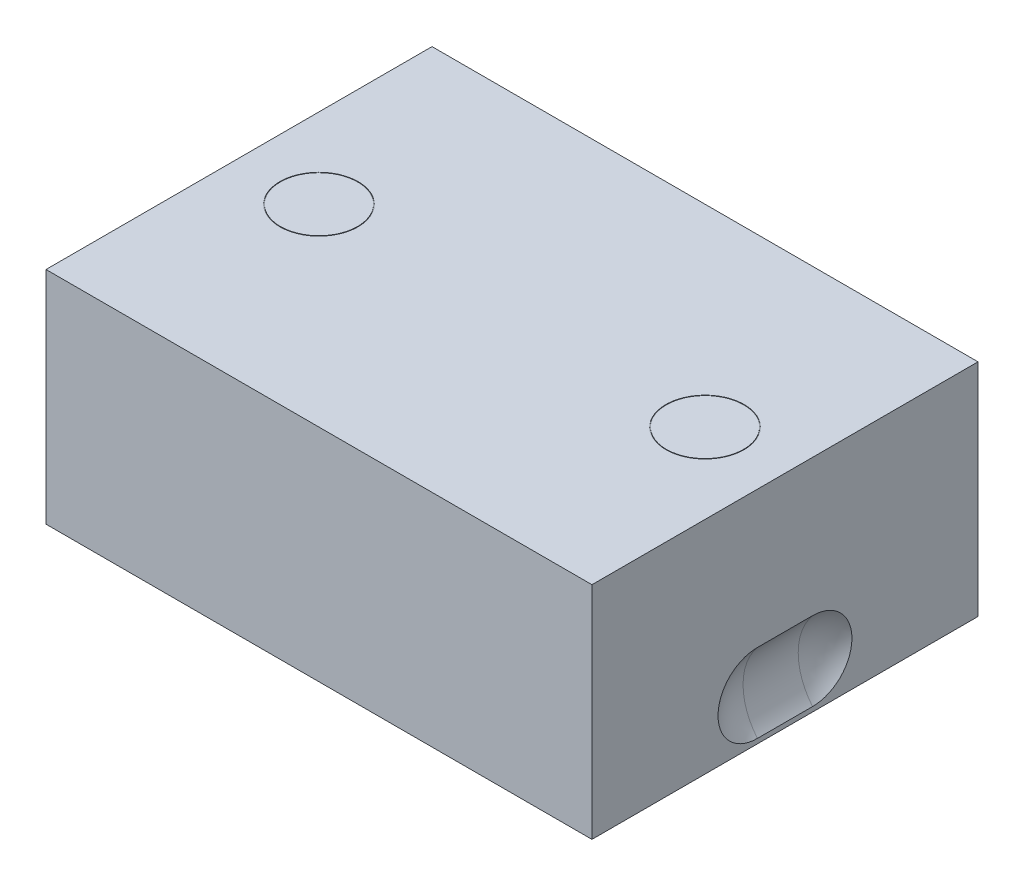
ISO-10303-21;
HEADER;
FILE_DESCRIPTION(('STEP AP214'),'2;1');
FILE_NAME('part.step','',(''),(''),'','','');
FILE_SCHEMA(('AUTOMOTIVE_DESIGN { 1 0 10303 214 1 1 1 1 }'));
ENDSEC;
DATA;
#1=APPLICATION_CONTEXT('core data for automotive mechanical design processes');
#2=APPLICATION_PROTOCOL_DEFINITION('international standard','automotive_design',2000,#1);
#3=PRODUCT_CONTEXT('',#1,'mechanical');
#4=PRODUCT('Part','Part','',(#3));
#5=PRODUCT_RELATED_PRODUCT_CATEGORY('part','',(#4));
#6=PRODUCT_DEFINITION_FORMATION('','',#4);
#7=PRODUCT_DEFINITION_CONTEXT('part definition',#1,'design');
#8=PRODUCT_DEFINITION('design','',#6,#7);
#9=PRODUCT_DEFINITION_SHAPE('','',#8);
#10=(LENGTH_UNIT() NAMED_UNIT(*) SI_UNIT(.MILLI.,.METRE.));
#11=(NAMED_UNIT(*) PLANE_ANGLE_UNIT() SI_UNIT($,.RADIAN.));
#12=(NAMED_UNIT(*) SI_UNIT($,.STERADIAN.) SOLID_ANGLE_UNIT());
#13=UNCERTAINTY_MEASURE_WITH_UNIT(LENGTH_MEASURE(1.E-05),#10,'distance_accuracy_value','');
#14=(GEOMETRIC_REPRESENTATION_CONTEXT(3) GLOBAL_UNCERTAINTY_ASSIGNED_CONTEXT((#13)) GLOBAL_UNIT_ASSIGNED_CONTEXT((#10,
#11,#12)) REPRESENTATION_CONTEXT('',''));
#15=CARTESIAN_POINT('',(0.,0.,0.));
#16=DIRECTION('',(0.,0.,1.));
#17=DIRECTION('',(1.,0.,0.));
#18=AXIS2_PLACEMENT_3D('',#15,#16,#17);
#19=CARTESIAN_POINT('',(35.,91.5,0.));
#20=DIRECTION('',(0.,1.,0.));
#21=DIRECTION('',(0.,0.,1.));
#22=AXIS2_PLACEMENT_3D('',#19,#20,#21);
#23=PLANE('',#22);
#24=CARTESIAN_POINT('',(35.,91.5,0.));
#25=DIRECTION('',(0.,-1.,0.));
#26=DIRECTION('',(0.,0.,-1.));
#27=AXIS2_PLACEMENT_3D('',#24,#25,#26);
#28=CIRCLE('',#27,7.);
#29=CARTESIAN_POINT('',(35.,91.5,-7.));
#30=VERTEX_POINT('',#29);
#31=EDGE_CURVE('E9',#30,#30,#28,.F.);
#32=ORIENTED_EDGE('',*,*,#31,.F.);
#33=EDGE_LOOP('',(#32));
#34=FACE_BOUND('',#33,.T.);
#35=ADVANCED_FACE('F14',(#34),#23,.F.);
#36=CARTESIAN_POINT('',(35.,95.,0.));
#37=DIRECTION('',(0.,1.,0.));
#38=DIRECTION('',(0.,0.,1.));
#39=AXIS2_PLACEMENT_3D('',#36,#37,#38);
#40=PLANE('',#39);
#41=CARTESIAN_POINT('',(-35.,95.,0.));
#42=DIRECTION('',(0.,1.,0.));
#43=DIRECTION('',(0.,0.,1.));
#44=AXIS2_PLACEMENT_3D('',#41,#42,#43);
#45=CIRCLE('',#44,7.1);
#46=CARTESIAN_POINT('',(-35.,95.,7.1));
#47=VERTEX_POINT('',#46);
#48=EDGE_CURVE('E344',#47,#47,#45,.T.);
#49=ORIENTED_EDGE('',*,*,#48,.F.);
#50=EDGE_LOOP('',(#49));
#51=FACE_BOUND('',#50,.T.);
#52=CARTESIAN_POINT('',(35.,95.,0.));
#53=DIRECTION('',(0.,1.,0.));
#54=DIRECTION('',(0.,0.,1.));
#55=AXIS2_PLACEMENT_3D('',#52,#53,#54);
#56=CIRCLE('',#55,7.1);
#57=CARTESIAN_POINT('',(35.,95.,7.1));
#58=VERTEX_POINT('',#57);
#59=EDGE_CURVE('E330',#58,#58,#56,.T.);
#60=ORIENTED_EDGE('',*,*,#59,.F.);
#61=EDGE_LOOP('',(#60));
#62=FACE_BOUND('',#61,.T.);
#63=DIRECTION('',(0.,0.,-1.));
#64=VECTOR('',#63,1.);
#65=CARTESIAN_POINT('',(49.5,95.,-35.));
#66=LINE('',#65,#64);
#67=CARTESIAN_POINT('',(49.5,95.,-35.));
#68=VERTEX_POINT('',#67);
#69=CARTESIAN_POINT('',(49.5,95.,35.));
#70=VERTEX_POINT('',#69);
#71=EDGE_CURVE('E92',#68,#70,#66,.F.);
#72=ORIENTED_EDGE('',*,*,#71,.F.);
#73=DIRECTION('',(-1.,0.,0.));
#74=VECTOR('',#73,1.);
#75=CARTESIAN_POINT('',(-49.5,95.,-35.));
#76=LINE('',#75,#74);
#77=CARTESIAN_POINT('',(-49.5,95.,-35.));
#78=VERTEX_POINT('',#77);
#79=EDGE_CURVE('E102',#78,#68,#76,.F.);
#80=ORIENTED_EDGE('',*,*,#79,.F.);
#81=DIRECTION('',(0.,0.,1.));
#82=VECTOR('',#81,1.);
#83=CARTESIAN_POINT('',(-49.5,95.,35.));
#84=LINE('',#83,#82);
#85=CARTESIAN_POINT('',(-49.5,95.,35.));
#86=VERTEX_POINT('',#85);
#87=EDGE_CURVE('E108',#86,#78,#84,.F.);
#88=ORIENTED_EDGE('',*,*,#87,.F.);
#89=DIRECTION('',(1.,0.,0.));
#90=VECTOR('',#89,1.);
#91=CARTESIAN_POINT('',(49.5,95.,35.));
#92=LINE('',#91,#90);
#93=EDGE_CURVE('E107',#70,#86,#92,.F.);
#94=ORIENTED_EDGE('',*,*,#93,.F.);
#95=EDGE_LOOP('',(#72,#80,#88,#94));
#96=FACE_BOUND('',#95,.T.);
#97=ADVANCED_FACE('F175',(#51,#62,#96),#40,.T.);
#98=CARTESIAN_POINT('',(-35.,91.5,0.));
#99=DIRECTION('',(0.,1.,0.));
#100=DIRECTION('',(0.,0.,1.));
#101=AXIS2_PLACEMENT_3D('',#98,#99,#100);
#102=PLANE('',#101);
#103=CARTESIAN_POINT('',(-35.,91.5,0.));
#104=DIRECTION('',(0.,1.,0.));
#105=DIRECTION('',(0.,0.,1.));
#106=AXIS2_PLACEMENT_3D('',#103,#104,#105);
#107=CIRCLE('',#106,7.);
#108=CARTESIAN_POINT('',(-35.,91.5,7.));
#109=VERTEX_POINT('',#108);
#110=EDGE_CURVE('E23',#109,#109,#107,.T.);
#111=ORIENTED_EDGE('',*,*,#110,.F.);
#112=EDGE_LOOP('',(#111));
#113=FACE_BOUND('',#112,.T.);
#114=ADVANCED_FACE('F172',(#113),#102,.F.);
#115=CARTESIAN_POINT('',(-35.,77.25,0.));
#116=DIRECTION('',(0.,1.,0.));
#117=DIRECTION('',(0.,0.,1.));
#118=AXIS2_PLACEMENT_3D('',#115,#116,#117);
#119=CYLINDRICAL_SURFACE('',#118,7.);
#120=ORIENTED_EDGE('',*,*,#110,.T.);
#121=EDGE_LOOP('',(#120));
#122=FACE_BOUND('',#121,.T.);
#123=CARTESIAN_POINT('',(-35.,63.,0.));
#124=DIRECTION('',(0.,1.,0.));
#125=DIRECTION('',(0.,0.,1.));
#126=AXIS2_PLACEMENT_3D('',#123,#124,#125);
#127=CIRCLE('',#126,7.);
#128=CARTESIAN_POINT('',(-35.,63.,7.));
#129=VERTEX_POINT('',#128);
#130=EDGE_CURVE('E17',#129,#129,#127,.F.);
#131=ORIENTED_EDGE('',*,*,#130,.T.);
#132=EDGE_LOOP('',(#131));
#133=FACE_BOUND('',#132,.T.);
#134=ADVANCED_FACE('F174',(#122,#133),#119,.F.);
#135=CARTESIAN_POINT('',(-40.6,63.,0.));
#136=DIRECTION('',(0.,-1.,0.));
#137=DIRECTION('',(0.,0.,-1.));
#138=AXIS2_PLACEMENT_3D('',#135,#136,#137);
#139=PLANE('',#138);
#140=CARTESIAN_POINT('',(-35.,63.,0.));
#141=DIRECTION('',(0.,1.,0.));
#142=DIRECTION('',(0.,0.,1.));
#143=AXIS2_PLACEMENT_3D('',#140,#141,#142);
#144=CIRCLE('',#143,4.2);
#145=CARTESIAN_POINT('',(-35.,63.,4.2));
#146=VERTEX_POINT('',#145);
#147=EDGE_CURVE('E319',#146,#146,#144,.F.);
#148=ORIENTED_EDGE('',*,*,#147,.T.);
#149=EDGE_LOOP('',(#148));
#150=FACE_BOUND('',#149,.T.);
#151=ORIENTED_EDGE('',*,*,#130,.F.);
#152=EDGE_LOOP('',(#151));
#153=FACE_BOUND('',#152,.T.);
#154=ADVANCED_FACE('F216',(#150,#153),#139,.F.);
#155=CARTESIAN_POINT('',(-35.,56.45,0.));
#156=DIRECTION('',(0.,1.,0.));
#157=DIRECTION('',(0.,0.,1.));
#158=AXIS2_PLACEMENT_3D('',#155,#156,#157);
#159=CYLINDRICAL_SURFACE('',#158,4.2);
#160=ORIENTED_EDGE('',*,*,#147,.F.);
#161=EDGE_LOOP('',(#160));
#162=FACE_BOUND('',#161,.T.);
#163=CARTESIAN_POINT('',(-35.,50.,0.));
#164=DIRECTION('',(0.,1.,0.));
#165=DIRECTION('',(0.,0.,1.));
#166=AXIS2_PLACEMENT_3D('',#163,#164,#165);
#167=CIRCLE('',#166,4.2);
#168=CARTESIAN_POINT('',(-35.,50.,4.2));
#169=VERTEX_POINT('',#168);
#170=EDGE_CURVE('E313',#169,#169,#167,.T.);
#171=ORIENTED_EDGE('',*,*,#170,.F.);
#172=EDGE_LOOP('',(#171));
#173=FACE_BOUND('',#172,.T.);
#174=ADVANCED_FACE('F225',(#162,#173),#159,.F.);
#175=CARTESIAN_POINT('',(-38.5,50.,0.));
#176=DIRECTION('',(0.,-1.,0.));
#177=DIRECTION('',(0.,0.,-1.));
#178=AXIS2_PLACEMENT_3D('',#175,#176,#177);
#179=PLANE('',#178);
#180=CARTESIAN_POINT('',(-35.,50.,0.));
#181=DIRECTION('',(0.,1.,0.));
#182=DIRECTION('',(0.,0.,1.));
#183=AXIS2_PLACEMENT_3D('',#180,#181,#182);
#184=CIRCLE('',#183,7.);
#185=CARTESIAN_POINT('',(-35.,50.,7.));
#186=VERTEX_POINT('',#185);
#187=EDGE_CURVE('E301',#186,#186,#184,.T.);
#188=ORIENTED_EDGE('',*,*,#187,.F.);
#189=EDGE_LOOP('',(#188));
#190=FACE_BOUND('',#189,.T.);
#191=ORIENTED_EDGE('',*,*,#170,.T.);
#192=EDGE_LOOP('',(#191));
#193=FACE_BOUND('',#192,.T.);
#194=ADVANCED_FACE('F233',(#190,#193),#179,.T.);
#195=CARTESIAN_POINT('',(-35.,52.5,0.));
#196=DIRECTION('',(0.,1.,0.));
#197=DIRECTION('',(0.,0.,1.));
#198=AXIS2_PLACEMENT_3D('',#195,#196,#197);
#199=CYLINDRICAL_SURFACE('',#198,7.);
#200=ORIENTED_EDGE('',*,*,#187,.T.);
#201=EDGE_LOOP('',(#200));
#202=FACE_BOUND('',#201,.T.);
#203=CARTESIAN_POINT('',(-35.,55.,0.));
#204=DIRECTION('',(0.,1.,0.));
#205=DIRECTION('',(0.,0.,1.));
#206=AXIS2_PLACEMENT_3D('',#203,#204,#205);
#207=CIRCLE('',#206,7.);
#208=CARTESIAN_POINT('',(-35.,55.,7.));
#209=VERTEX_POINT('',#208);
#210=EDGE_CURVE('E120',#209,#209,#207,.F.);
#211=ORIENTED_EDGE('',*,*,#210,.T.);
#212=EDGE_LOOP('',(#211));
#213=FACE_BOUND('',#212,.T.);
#214=ADVANCED_FACE('F241',(#202,#213),#199,.T.);
#215=CARTESIAN_POINT('',(38.5,50.,0.));
#216=DIRECTION('',(0.,-1.,0.));
#217=DIRECTION('',(0.,0.,-1.));
#218=AXIS2_PLACEMENT_3D('',#215,#216,#217);
#219=PLANE('',#218);
#220=CARTESIAN_POINT('',(35.,50.,0.));
#221=DIRECTION('',(0.,-1.,0.));
#222=DIRECTION('',(0.,0.,-1.));
#223=AXIS2_PLACEMENT_3D('',#220,#221,#222);
#224=CIRCLE('',#223,7.);
#225=CARTESIAN_POINT('',(35.,50.,-7.));
#226=VERTEX_POINT('',#225);
#227=EDGE_CURVE('E98',#226,#226,#224,.F.);
#228=ORIENTED_EDGE('',*,*,#227,.F.);
#229=EDGE_LOOP('',(#228));
#230=FACE_BOUND('',#229,.T.);
#231=CARTESIAN_POINT('',(35.,50.,0.));
#232=DIRECTION('',(0.,-1.,0.));
#233=DIRECTION('',(0.,0.,-1.));
#234=AXIS2_PLACEMENT_3D('',#231,#232,#233);
#235=CIRCLE('',#234,4.2);
#236=CARTESIAN_POINT('',(35.,50.,-4.2));
#237=VERTEX_POINT('',#236);
#238=EDGE_CURVE('E86',#237,#237,#235,.F.);
#239=ORIENTED_EDGE('',*,*,#238,.T.);
#240=EDGE_LOOP('',(#239));
#241=FACE_BOUND('',#240,.T.);
#242=ADVANCED_FACE('F237',(#230,#241),#219,.T.);
#243=CARTESIAN_POINT('',(35.,56.45,0.));
#244=DIRECTION('',(0.,-1.,0.));
#245=DIRECTION('',(0.,0.,-1.));
#246=AXIS2_PLACEMENT_3D('',#243,#244,#245);
#247=CYLINDRICAL_SURFACE('',#246,4.2);
#248=CARTESIAN_POINT('',(35.,63.,0.));
#249=DIRECTION('',(0.,-1.,0.));
#250=DIRECTION('',(0.,0.,-1.));
#251=AXIS2_PLACEMENT_3D('',#248,#249,#250);
#252=CIRCLE('',#251,4.2);
#253=CARTESIAN_POINT('',(35.,63.,-4.2));
#254=VERTEX_POINT('',#253);
#255=EDGE_CURVE('E316',#254,#254,#252,.T.);
#256=ORIENTED_EDGE('',*,*,#255,.F.);
#257=EDGE_LOOP('',(#256));
#258=FACE_BOUND('',#257,.T.);
#259=ORIENTED_EDGE('',*,*,#238,.F.);
#260=EDGE_LOOP('',(#259));
#261=FACE_BOUND('',#260,.T.);
#262=ADVANCED_FACE('F229',(#258,#261),#247,.F.);
#263=CARTESIAN_POINT('',(40.6,63.,0.));
#264=DIRECTION('',(0.,-1.,0.));
#265=DIRECTION('',(0.,0.,-1.));
#266=AXIS2_PLACEMENT_3D('',#263,#264,#265);
#267=PLANE('',#266);
#268=CARTESIAN_POINT('',(35.,63.,0.));
#269=DIRECTION('',(0.,-1.,0.));
#270=DIRECTION('',(0.,0.,-1.));
#271=AXIS2_PLACEMENT_3D('',#268,#269,#270);
#272=CIRCLE('',#271,7.);
#273=CARTESIAN_POINT('',(35.,63.,-7.));
#274=VERTEX_POINT('',#273);
#275=EDGE_CURVE('E321',#274,#274,#272,.T.);
#276=ORIENTED_EDGE('',*,*,#275,.F.);
#277=EDGE_LOOP('',(#276));
#278=FACE_BOUND('',#277,.T.);
#279=ORIENTED_EDGE('',*,*,#255,.T.);
#280=EDGE_LOOP('',(#279));
#281=FACE_BOUND('',#280,.T.);
#282=ADVANCED_FACE('F221',(#278,#281),#267,.F.);
#283=CARTESIAN_POINT('',(35.,77.25,0.));
#284=DIRECTION('',(0.,-1.,0.));
#285=DIRECTION('',(0.,0.,-1.));
#286=AXIS2_PLACEMENT_3D('',#283,#284,#285);
#287=CYLINDRICAL_SURFACE('',#286,7.);
#288=ORIENTED_EDGE('',*,*,#275,.T.);
#289=EDGE_LOOP('',(#288));
#290=FACE_BOUND('',#289,.T.);
#291=ORIENTED_EDGE('',*,*,#31,.T.);
#292=EDGE_LOOP('',(#291));
#293=FACE_BOUND('',#292,.T.);
#294=ADVANCED_FACE('F218',(#290,#293),#287,.F.);
#295=CARTESIAN_POINT('',(35.,52.5,0.));
#296=DIRECTION('',(0.,-1.,0.));
#297=DIRECTION('',(0.,0.,-1.));
#298=AXIS2_PLACEMENT_3D('',#295,#296,#297);
#299=CYLINDRICAL_SURFACE('',#298,7.);
#300=ORIENTED_EDGE('',*,*,#227,.T.);
#301=EDGE_LOOP('',(#300));
#302=FACE_BOUND('',#301,.T.);
#303=CARTESIAN_POINT('',(35.,55.,0.));
#304=DIRECTION('',(0.,-1.,0.));
#305=DIRECTION('',(0.,0.,-1.));
#306=AXIS2_PLACEMENT_3D('',#303,#304,#305);
#307=CIRCLE('',#306,7.);
#308=CARTESIAN_POINT('',(35.,55.,-7.));
#309=VERTEX_POINT('',#308);
#310=EDGE_CURVE('E134',#309,#309,#307,.T.);
#311=ORIENTED_EDGE('',*,*,#310,.T.);
#312=EDGE_LOOP('',(#311));
#313=FACE_BOUND('',#312,.T.);
#314=ADVANCED_FACE('F209',(#302,#313),#299,.T.);
#315=CARTESIAN_POINT('',(-57.9999999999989,63.,-5.00000000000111));
#316=DIRECTION('',(0.246752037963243,0.939240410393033,0.238622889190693));
#317=DIRECTION('',(-0.896514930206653,0.127757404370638,0.424192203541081));
#318=AXIS2_PLACEMENT_3D('',#315,#316,#317);
#319=SPHERICAL_SURFACE('',#318,11.1);
#320=CARTESIAN_POINT('',(-58.,63.,-5.));
#321=DIRECTION('',(0.,0.,1.));
#322=DIRECTION('',(1.,0.,0.));
#323=AXIS2_PLACEMENT_3D('',#320,#321,#322);
#324=CIRCLE('',#323,11.1);
#325=CARTESIAN_POINT('',(-49.5,55.8613726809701,-5.));
#326=VERTEX_POINT('',#325);
#327=CARTESIAN_POINT('',(-49.5,70.1386273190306,-5.));
#328=VERTEX_POINT('',#327);
#329=EDGE_CURVE('E302',#326,#328,#324,.T.);
#330=ORIENTED_EDGE('',*,*,#329,.T.);
#331=CARTESIAN_POINT('',(-49.5,55.8613726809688,-5.));
#332=CARTESIAN_POINT('',(-49.5,55.8613510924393,-5.2007761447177));
#333=CARTESIAN_POINT('',(-49.5,55.8698421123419,-5.40154918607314));
#334=CARTESIAN_POINT('',(-49.5,55.9036934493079,-5.80165887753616));
#335=CARTESIAN_POINT('',(-49.5,55.9290529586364,-6.000995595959));
#336=CARTESIAN_POINT('',(-49.5,55.9964616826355,-6.3966828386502));
#337=CARTESIAN_POINT('',(-49.5,56.0384991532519,-6.59303536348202));
#338=CARTESIAN_POINT('',(-49.5,56.1389579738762,-6.98150076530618));
#339=CARTESIAN_POINT('',(-49.5,56.1973791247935,-7.17361369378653));
#340=CARTESIAN_POINT('',(-49.5,56.3302113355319,-7.55229163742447));
#341=CARTESIAN_POINT('',(-49.5,56.4046269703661,-7.73885504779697));
#342=CARTESIAN_POINT('',(-49.5,56.5689392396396,-8.10511814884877));
#343=CARTESIAN_POINT('',(-49.5,56.6588415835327,-8.2848152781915));
#344=CARTESIAN_POINT('',(-49.5,56.8534137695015,-8.63589520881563));
#345=CARTESIAN_POINT('',(-49.5,56.9580752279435,-8.80728265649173));
#346=CARTESIAN_POINT('',(-49.5,57.1815016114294,-9.14069585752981));
#347=CARTESIAN_POINT('',(-49.5,57.300271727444,-9.30271813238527));
#348=CARTESIAN_POINT('',(-49.5,57.5509964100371,-9.61612584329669));
#349=CARTESIAN_POINT('',(-49.5,57.6829463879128,-9.76751495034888));
#350=CARTESIAN_POINT('',(-49.5,57.9591786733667,-10.058696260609));
#351=CARTESIAN_POINT('',(-49.5,58.1034655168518,-10.198484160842));
#352=CARTESIAN_POINT('',(-49.5,58.4032709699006,-10.4653776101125));
#353=CARTESIAN_POINT('',(-49.5,58.5587871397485,-10.5924858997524));
#354=CARTESIAN_POINT('',(-49.5,58.8800329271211,-10.8331956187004));
#355=CARTESIAN_POINT('',(-49.5,59.0457662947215,-10.9467920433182));
#356=CARTESIAN_POINT('',(-49.5,59.3861453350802,-11.159571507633));
#357=CARTESIAN_POINT('',(-49.5,59.5607873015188,-11.2587604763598));
#358=CARTESIAN_POINT('',(-49.5,59.9178710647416,-11.4421097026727));
#359=CARTESIAN_POINT('',(-49.5,60.1003157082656,-11.5262644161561));
#360=CARTESIAN_POINT('',(-49.5,60.4715990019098,-11.6788819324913));
#361=CARTESIAN_POINT('',(-49.5,60.6604359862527,-11.7473487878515));
#362=CARTESIAN_POINT('',(-49.5,61.0432103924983,-11.8681330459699));
#363=CARTESIAN_POINT('',(-49.5,61.2371479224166,-11.9204501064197));
#364=CARTESIAN_POINT('',(-49.5,61.6287427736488,-12.008561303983));
#365=CARTESIAN_POINT('',(-49.5,61.8264001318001,-12.0443552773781));
#366=CARTESIAN_POINT('',(-49.5,62.2240275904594,-12.0991650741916));
#367=CARTESIAN_POINT('',(-49.5,62.423997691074,-12.118180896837));
#368=CARTESIAN_POINT('',(-49.5,62.8248357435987,-12.1392995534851));
#369=CARTESIAN_POINT('',(-49.5,63.0257037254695,-12.1414018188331));
#370=CARTESIAN_POINT('',(-49.5,63.4268984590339,-12.1286770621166));
#371=CARTESIAN_POINT('',(-49.5,63.6272252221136,-12.113850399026));
#372=CARTESIAN_POINT('',(-49.5,64.0259544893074,-12.0673694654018));
#373=CARTESIAN_POINT('',(-49.5,64.224356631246,-12.0357120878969));
#374=CARTESIAN_POINT('',(-49.5,64.6177155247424,-11.955807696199));
#375=CARTESIAN_POINT('',(-49.5,64.8126735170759,-11.9075667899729));
#376=CARTESIAN_POINT('',(-49.5,65.1979040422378,-11.794815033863));
#377=CARTESIAN_POINT('',(-49.5,65.388174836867,-11.73029824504));
#378=CARTESIAN_POINT('',(-49.5,65.7625345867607,-11.5854890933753));
#379=CARTESIAN_POINT('',(-49.5,65.9466257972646,-11.505202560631));
#380=CARTESIAN_POINT('',(-49.5,66.3074632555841,-11.329374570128));
#381=CARTESIAN_POINT('',(-49.5,66.4842065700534,-11.2338270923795));
#382=CARTESIAN_POINT('',(-49.5,66.8289501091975,-11.0282175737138));
#383=CARTESIAN_POINT('',(-49.5,66.9969535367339,-10.9181609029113));
#384=CARTESIAN_POINT('',(-49.5,67.323145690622,-10.6842504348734));
#385=CARTESIAN_POINT('',(-49.5,67.4813312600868,-10.5603922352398));
#386=CARTESIAN_POINT('',(-49.5,67.7866477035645,-10.2998363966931));
#387=CARTESIAN_POINT('',(-49.5,67.93378263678,-10.1631435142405));
#388=CARTESIAN_POINT('',(-49.5,68.2160483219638,-9.87781916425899));
#389=CARTESIAN_POINT('',(-49.5,68.3511763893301,-9.7291850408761));
#390=CARTESIAN_POINT('',(-49.5,68.6083861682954,-9.42111487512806));
#391=CARTESIAN_POINT('',(-49.5,68.7304723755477,-9.26168258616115));
#392=CARTESIAN_POINT('',(-49.5,68.9608430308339,-8.9330196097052));
#393=CARTESIAN_POINT('',(-49.5,69.0691204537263,-8.76378399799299));
#394=CARTESIAN_POINT('',(-49.5,69.2710278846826,-8.41679668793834));
#395=CARTESIAN_POINT('',(-49.5,69.3646583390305,-8.23904524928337));
#396=CARTESIAN_POINT('',(-49.5,69.5366646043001,-7.87617071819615));
#397=CARTESIAN_POINT('',(-49.5,69.6150306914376,-7.69104301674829));
#398=CARTESIAN_POINT('',(-49.5,69.7558746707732,-7.31484249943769));
#399=CARTESIAN_POINT('',(-49.5,69.8183529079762,-7.12376981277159));
#400=CARTESIAN_POINT('',(-49.5,69.9269086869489,-6.73729011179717));
#401=CARTESIAN_POINT('',(-49.5,69.9730070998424,-6.54188895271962));
#402=CARTESIAN_POINT('',(-49.5,70.0485699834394,-6.14797649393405));
#403=CARTESIAN_POINT('',(-49.5,70.0780426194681,-5.94946677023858));
#404=CARTESIAN_POINT('',(-49.5,70.112281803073,-5.62543751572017));
#405=CARTESIAN_POINT('',(-49.5,70.1221676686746,-5.50043666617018));
#406=CARTESIAN_POINT('',(-49.5,70.1353356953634,-5.25029488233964));
#407=CARTESIAN_POINT('',(-49.5,70.138628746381,-5.12515452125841));
#408=CARTESIAN_POINT('',(-49.5,70.1386273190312,-5.));
#409=B_SPLINE_CURVE_WITH_KNOTS('',3,(#331,#332,#333,#334,#335,#336,#337,#338,#339,#340,#341,
#342,#343,#344,#345,#346,#347,#348,#349,#350,#351,#352,#353,#354,#355,#356,#357,#358,#359,#360,
#361,#362,#363,#364,#365,#366,#367,#368,#369,#370,#371,#372,#373,#374,#375,#376,#377,#378,#379,
#380,#381,#382,#383,#384,#385,#386,#387,#388,#389,#390,#391,#392,#393,#394,#395,#396,#397,#398,
#399,#400,#401,#402,#403,#404,#405,#406,#407,#408),.UNSPECIFIED.,.F.,.F.,(4,2,2,2,2,2,2,2,2,2,2,
2,2,2,2,2,2,2,2,2,2,2,2,2,2,2,2,2,2,2,2,2,2,2,2,2,2,2,4),(0.,0.602144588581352,1.20426034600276,
1.80595286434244,2.40763807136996,3.00949561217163,3.61157551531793,4.21331478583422,
4.81527614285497,5.41702864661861,6.019003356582,6.62084767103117,7.22291421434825,
7.82473228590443,8.42677183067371,9.0286556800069,9.63055228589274,10.2324548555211,
10.8343574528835,11.4362802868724,12.0381903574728,12.6402115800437,13.2420113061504,
13.8440309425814,14.4458284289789,15.0478638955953,15.6496771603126,16.2516829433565,
16.8534665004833,17.4553842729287,18.0570938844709,18.6591084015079,19.2611045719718,
19.8634829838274,20.4658483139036,21.0674433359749,21.6687426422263,22.0447563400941,
22.4201484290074),.UNSPECIFIED.);
#410=EDGE_CURVE('E114',#326,#328,#409,.T.);
#411=ORIENTED_EDGE('',*,*,#410,.F.);
#412=EDGE_LOOP('',(#330,#411));
#413=FACE_BOUND('',#412,.T.);
#414=ADVANCED_FACE('F264',(#413),#319,.F.);
#415=CARTESIAN_POINT('',(-57.9999999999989,63.,5.00000000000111));
#416=DIRECTION('',(0.246752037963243,0.939240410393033,0.238622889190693));
#417=DIRECTION('',(-0.896514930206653,0.127757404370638,0.424192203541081));
#418=AXIS2_PLACEMENT_3D('',#415,#416,#417);
#419=SPHERICAL_SURFACE('',#418,11.1);
#420=CARTESIAN_POINT('',(-58.,63.,5.));
#421=DIRECTION('',(0.,0.,1.));
#422=DIRECTION('',(1.,0.,0.));
#423=AXIS2_PLACEMENT_3D('',#420,#421,#422);
#424=CIRCLE('',#423,11.1);
#425=CARTESIAN_POINT('',(-49.5,55.8613726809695,5.));
#426=VERTEX_POINT('',#425);
#427=CARTESIAN_POINT('',(-49.5,70.1386273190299,5.));
#428=VERTEX_POINT('',#427);
#429=EDGE_CURVE('E298',#426,#428,#424,.T.);
#430=ORIENTED_EDGE('',*,*,#429,.F.);
#431=CARTESIAN_POINT('',(-49.5,70.1386273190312,5.));
#432=CARTESIAN_POINT('',(-49.5,70.1386489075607,5.2007761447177));
#433=CARTESIAN_POINT('',(-49.5,70.1301578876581,5.40154918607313));
#434=CARTESIAN_POINT('',(-49.5,70.0963065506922,5.80165887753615));
#435=CARTESIAN_POINT('',(-49.5,70.0709470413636,6.00099559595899));
#436=CARTESIAN_POINT('',(-49.5,70.0035383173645,6.39668283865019));
#437=CARTESIAN_POINT('',(-49.5,69.9615008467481,6.593035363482));
#438=CARTESIAN_POINT('',(-49.5,69.8610420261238,6.98150076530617));
#439=CARTESIAN_POINT('',(-49.5,69.8026208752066,7.17361369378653));
#440=CARTESIAN_POINT('',(-49.5,69.6697886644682,7.55229163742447));
#441=CARTESIAN_POINT('',(-49.5,69.595373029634,7.73885504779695));
#442=CARTESIAN_POINT('',(-49.5,69.4310607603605,8.10511814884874));
#443=CARTESIAN_POINT('',(-49.5,69.3411584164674,8.28481527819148));
#444=CARTESIAN_POINT('',(-49.5,69.1465862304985,8.63589520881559));
#445=CARTESIAN_POINT('',(-49.5,69.0419247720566,8.80728265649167));
#446=CARTESIAN_POINT('',(-49.5,68.8184983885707,9.14069585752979));
#447=CARTESIAN_POINT('',(-49.5,68.6997282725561,9.30271813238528));
#448=CARTESIAN_POINT('',(-49.5,68.449003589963,9.6161258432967));
#449=CARTESIAN_POINT('',(-49.5,68.3170536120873,9.76751495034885));
#450=CARTESIAN_POINT('',(-49.5,68.0408213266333,10.0586962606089));
#451=CARTESIAN_POINT('',(-49.5,67.8965344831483,10.198484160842));
#452=CARTESIAN_POINT('',(-49.5,67.5967290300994,10.4653776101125));
#453=CARTESIAN_POINT('',(-49.5,67.4412128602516,10.5924858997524));
#454=CARTESIAN_POINT('',(-49.5,67.1199670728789,10.8331956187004));
#455=CARTESIAN_POINT('',(-49.5,66.9542337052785,10.9467920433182));
#456=CARTESIAN_POINT('',(-49.5,66.6138546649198,11.159571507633));
#457=CARTESIAN_POINT('',(-49.5,66.4392126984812,11.2587604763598));
#458=CARTESIAN_POINT('',(-49.5,66.0821289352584,11.4421097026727));
#459=CARTESIAN_POINT('',(-49.5,65.8996842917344,11.5262644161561));
#460=CARTESIAN_POINT('',(-49.5,65.5284009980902,11.6788819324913));
#461=CARTESIAN_POINT('',(-49.5,65.3395640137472,11.7473487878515));
#462=CARTESIAN_POINT('',(-49.5,64.9567896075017,11.8681330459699));
#463=CARTESIAN_POINT('',(-49.5,64.7628520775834,11.9204501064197));
#464=CARTESIAN_POINT('',(-49.5,64.3712572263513,12.008561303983));
#465=CARTESIAN_POINT('',(-49.5,64.1735998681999,12.0443552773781));
#466=CARTESIAN_POINT('',(-49.5,63.7759724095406,12.0991650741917));
#467=CARTESIAN_POINT('',(-49.5,63.576002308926,12.118180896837));
#468=CARTESIAN_POINT('',(-49.5,63.1751642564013,12.1392995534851));
#469=CARTESIAN_POINT('',(-49.5,62.9742962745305,12.1414018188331));
#470=CARTESIAN_POINT('',(-49.5,62.5731015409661,12.1286770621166));
#471=CARTESIAN_POINT('',(-49.5,62.3727747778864,12.113850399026));
#472=CARTESIAN_POINT('',(-49.5,61.9740455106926,12.0673694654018));
#473=CARTESIAN_POINT('',(-49.5,61.775643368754,12.0357120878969));
#474=CARTESIAN_POINT('',(-49.5,61.3822844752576,11.955807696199));
#475=CARTESIAN_POINT('',(-49.5,61.187326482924,11.9075667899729));
#476=CARTESIAN_POINT('',(-49.5,60.8020959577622,11.794815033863));
#477=CARTESIAN_POINT('',(-49.5,60.611825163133,11.73029824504));
#478=CARTESIAN_POINT('',(-49.5,60.2374654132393,11.5854890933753));
#479=CARTESIAN_POINT('',(-49.5,60.0533742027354,11.505202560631));
#480=CARTESIAN_POINT('',(-49.5,59.6925367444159,11.329374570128));
#481=CARTESIAN_POINT('',(-49.5,59.5157934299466,11.2338270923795));
#482=CARTESIAN_POINT('',(-49.5,59.1710498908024,11.0282175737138));
#483=CARTESIAN_POINT('',(-49.5,59.0030464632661,10.9181609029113));
#484=CARTESIAN_POINT('',(-49.5,58.676854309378,10.6842504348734));
#485=CARTESIAN_POINT('',(-49.5,58.5186687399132,10.5603922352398));
#486=CARTESIAN_POINT('',(-49.5,58.2133522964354,10.2998363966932));
#487=CARTESIAN_POINT('',(-49.5,58.06621736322,10.1631435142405));
#488=CARTESIAN_POINT('',(-49.5,57.7839516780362,9.87781916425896));
#489=CARTESIAN_POINT('',(-49.5,57.6488236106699,9.72918504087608));
#490=CARTESIAN_POINT('',(-49.5,57.3916138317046,9.42111487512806));
#491=CARTESIAN_POINT('',(-49.5,57.2695276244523,9.26168258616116));
#492=CARTESIAN_POINT('',(-49.5,57.0391569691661,8.93301960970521));
#493=CARTESIAN_POINT('',(-49.5,56.9308795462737,8.763783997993));
#494=CARTESIAN_POINT('',(-49.5,56.7289721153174,8.41679668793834));
#495=CARTESIAN_POINT('',(-49.5,56.6353416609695,8.23904524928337));
#496=CARTESIAN_POINT('',(-49.5,56.4633353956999,7.87617071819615));
#497=CARTESIAN_POINT('',(-49.5,56.3849693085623,7.6910430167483));
#498=CARTESIAN_POINT('',(-49.5,56.2441253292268,7.31484249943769));
#499=CARTESIAN_POINT('',(-49.5,56.1816470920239,7.12376981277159));
#500=CARTESIAN_POINT('',(-49.5,56.0730913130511,6.73729011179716));
#501=CARTESIAN_POINT('',(-49.5,56.0269929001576,6.54188895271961));
#502=CARTESIAN_POINT('',(-49.5,55.9514300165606,6.14797649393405));
#503=CARTESIAN_POINT('',(-49.5,55.9219573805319,5.94946677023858));
#504=CARTESIAN_POINT('',(-49.5,55.887718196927,5.62543751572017));
#505=CARTESIAN_POINT('',(-49.5,55.8778323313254,5.50043666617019));
#506=CARTESIAN_POINT('',(-49.5,55.8646643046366,5.25029488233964));
#507=CARTESIAN_POINT('',(-49.5,55.861371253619,5.12515452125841));
#508=CARTESIAN_POINT('',(-49.5,55.8613726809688,5.));
#509=B_SPLINE_CURVE_WITH_KNOTS('',3,(#431,#432,#433,#434,#435,#436,#437,#438,#439,#440,#441,
#442,#443,#444,#445,#446,#447,#448,#449,#450,#451,#452,#453,#454,#455,#456,#457,#458,#459,#460,
#461,#462,#463,#464,#465,#466,#467,#468,#469,#470,#471,#472,#473,#474,#475,#476,#477,#478,#479,
#480,#481,#482,#483,#484,#485,#486,#487,#488,#489,#490,#491,#492,#493,#494,#495,#496,#497,#498,
#499,#500,#501,#502,#503,#504,#505,#506,#507,#508),.UNSPECIFIED.,.F.,.F.,(4,2,2,2,2,2,2,2,2,2,2,
2,2,2,2,2,2,2,2,2,2,2,2,2,2,2,2,2,2,2,2,2,2,2,2,2,2,2,4),(0.,0.602144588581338,1.20426034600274,
1.80595286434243,2.40763807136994,3.0094956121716,3.6115755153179,4.21331478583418,
4.81527614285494,5.41702864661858,6.01900335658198,6.62084767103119,7.22291421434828,
7.82473228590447,8.42677183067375,9.02865568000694,9.63055228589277,10.2324548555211,
10.8343574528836,11.4362802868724,12.0381903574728,12.6402115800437,13.2420113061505,
13.8440309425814,14.4458284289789,15.0478638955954,15.6496771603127,16.2516829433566,
16.8534665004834,17.4553842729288,18.0570938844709,18.6591084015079,19.2611045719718,
19.8634829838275,20.4658483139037,21.067443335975,21.6687426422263,22.0447563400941,
22.4201484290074),.UNSPECIFIED.);
#510=EDGE_CURVE('E111',#428,#426,#509,.T.);
#511=ORIENTED_EDGE('',*,*,#510,.F.);
#512=EDGE_LOOP('',(#430,#511));
#513=FACE_BOUND('',#512,.T.);
#514=ADVANCED_FACE('F152',(#513),#419,.F.);
#515=CARTESIAN_POINT('',(-58.,63.,0.));
#516=DIRECTION('',(0.,0.,1.));
#517=DIRECTION('',(1.,0.,0.));
#518=AXIS2_PLACEMENT_3D('',#515,#516,#517);
#519=CYLINDRICAL_SURFACE('',#518,11.1);
#520=ORIENTED_EDGE('',*,*,#329,.F.);
#521=DIRECTION('',(0.,0.,1.));
#522=VECTOR('',#521,1.);
#523=CARTESIAN_POINT('',(-49.5,55.8613726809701,35.));
#524=LINE('',#523,#522);
#525=EDGE_CURVE('E101',#426,#326,#524,.F.);
#526=ORIENTED_EDGE('',*,*,#525,.F.);
#527=ORIENTED_EDGE('',*,*,#429,.T.);
#528=DIRECTION('',(0.,0.,1.));
#529=VECTOR('',#528,1.);
#530=CARTESIAN_POINT('',(-49.5,70.1386273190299,35.));
#531=LINE('',#530,#529);
#532=EDGE_CURVE('E112',#328,#428,#531,.T.);
#533=ORIENTED_EDGE('',*,*,#532,.F.);
#534=EDGE_LOOP('',(#520,#526,#527,#533));
#535=FACE_BOUND('',#534,.T.);
#536=ADVANCED_FACE('F251',(#535),#519,.F.);
#537=CARTESIAN_POINT('',(57.9999999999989,63.,5.00000000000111));
#538=DIRECTION('',(0.246752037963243,0.939240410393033,0.238622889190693));
#539=DIRECTION('',(-0.896514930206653,0.127757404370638,0.424192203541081));
#540=AXIS2_PLACEMENT_3D('',#537,#538,#539);
#541=SPHERICAL_SURFACE('',#540,11.1);
#542=CARTESIAN_POINT('',(58.,63.,5.));
#543=DIRECTION('',(0.,0.,-1.));
#544=DIRECTION('',(-1.,0.,0.));
#545=AXIS2_PLACEMENT_3D('',#542,#543,#544);
#546=CIRCLE('',#545,11.1);
#547=CARTESIAN_POINT('',(49.5,55.8613726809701,5.));
#548=VERTEX_POINT('',#547);
#549=CARTESIAN_POINT('',(49.5,70.1386273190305,5.));
#550=VERTEX_POINT('',#549);
#551=EDGE_CURVE('E71',#548,#550,#546,.T.);
#552=ORIENTED_EDGE('',*,*,#551,.T.);
#553=CARTESIAN_POINT('',(49.5,55.8613726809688,5.));
#554=CARTESIAN_POINT('',(49.5,55.8613510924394,5.2007761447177));
#555=CARTESIAN_POINT('',(49.5,55.869842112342,5.40154918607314));
#556=CARTESIAN_POINT('',(49.5,55.9036934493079,5.80165887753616));
#557=CARTESIAN_POINT('',(49.5,55.9290529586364,6.00099559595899));
#558=CARTESIAN_POINT('',(49.5,55.9964616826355,6.3966828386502));
#559=CARTESIAN_POINT('',(49.5,56.0384991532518,6.59303536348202));
#560=CARTESIAN_POINT('',(49.5,56.1389579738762,6.98150076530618));
#561=CARTESIAN_POINT('',(49.5,56.1973791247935,7.17361369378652));
#562=CARTESIAN_POINT('',(49.5,56.3302113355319,7.55229163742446));
#563=CARTESIAN_POINT('',(49.5,56.4046269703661,7.73885504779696));
#564=CARTESIAN_POINT('',(49.5,56.5689392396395,8.10511814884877));
#565=CARTESIAN_POINT('',(49.5,56.6588415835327,8.28481527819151));
#566=CARTESIAN_POINT('',(49.5,56.8534137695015,8.63589520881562));
#567=CARTESIAN_POINT('',(49.5,56.9580752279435,8.80728265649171));
#568=CARTESIAN_POINT('',(49.5,57.1815016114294,9.1406958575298));
#569=CARTESIAN_POINT('',(49.5,57.300271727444,9.30271813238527));
#570=CARTESIAN_POINT('',(49.5,57.5509964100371,9.61612584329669));
#571=CARTESIAN_POINT('',(49.5,57.6829463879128,9.76751495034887));
#572=CARTESIAN_POINT('',(49.5,57.9591786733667,10.0586962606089));
#573=CARTESIAN_POINT('',(49.5,58.1034655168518,10.198484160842));
#574=CARTESIAN_POINT('',(49.5,58.4032709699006,10.4653776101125));
#575=CARTESIAN_POINT('',(49.5,58.5587871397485,10.5924858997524));
#576=CARTESIAN_POINT('',(49.5,58.8800329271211,10.8331956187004));
#577=CARTESIAN_POINT('',(49.5,59.0457662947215,10.9467920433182));
#578=CARTESIAN_POINT('',(49.5,59.3861453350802,11.1595715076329));
#579=CARTESIAN_POINT('',(49.5,59.5607873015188,11.2587604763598));
#580=CARTESIAN_POINT('',(49.5,59.9178710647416,11.4421097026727));
#581=CARTESIAN_POINT('',(49.5,60.1003157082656,11.5262644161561));
#582=CARTESIAN_POINT('',(49.5,60.4715990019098,11.6788819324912));
#583=CARTESIAN_POINT('',(49.5,60.6604359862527,11.7473487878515));
#584=CARTESIAN_POINT('',(49.5,61.0432103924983,11.8681330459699));
#585=CARTESIAN_POINT('',(49.5,61.2371479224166,11.9204501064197));
#586=CARTESIAN_POINT('',(49.5,61.6287427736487,12.008561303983));
#587=CARTESIAN_POINT('',(49.5,61.8264001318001,12.0443552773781));
#588=CARTESIAN_POINT('',(49.5,62.2240275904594,12.0991650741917));
#589=CARTESIAN_POINT('',(49.5,62.423997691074,12.118180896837));
#590=CARTESIAN_POINT('',(49.5,62.8248357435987,12.1392995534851));
#591=CARTESIAN_POINT('',(49.5,63.0257037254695,12.1414018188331));
#592=CARTESIAN_POINT('',(49.5,63.4268984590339,12.1286770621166));
#593=CARTESIAN_POINT('',(49.5,63.6272252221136,12.113850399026));
#594=CARTESIAN_POINT('',(49.5,64.0259544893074,12.0673694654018));
#595=CARTESIAN_POINT('',(49.5,64.224356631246,12.0357120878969));
#596=CARTESIAN_POINT('',(49.5,64.6177155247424,11.955807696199));
#597=CARTESIAN_POINT('',(49.5,64.8126735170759,11.9075667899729));
#598=CARTESIAN_POINT('',(49.5,65.1979040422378,11.794815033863));
#599=CARTESIAN_POINT('',(49.5,65.388174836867,11.7302982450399));
#600=CARTESIAN_POINT('',(49.5,65.7625345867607,11.5854890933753));
#601=CARTESIAN_POINT('',(49.5,65.9466257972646,11.505202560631));
#602=CARTESIAN_POINT('',(49.5,66.3074632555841,11.329374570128));
#603=CARTESIAN_POINT('',(49.5,66.4842065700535,11.2338270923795));
#604=CARTESIAN_POINT('',(49.5,66.8289501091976,11.0282175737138));
#605=CARTESIAN_POINT('',(49.5,66.9969535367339,10.9181609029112));
#606=CARTESIAN_POINT('',(49.5,67.323145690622,10.6842504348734));
#607=CARTESIAN_POINT('',(49.5,67.4813312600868,10.5603922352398));
#608=CARTESIAN_POINT('',(49.5,67.7866477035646,10.2998363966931));
#609=CARTESIAN_POINT('',(49.5,67.93378263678,10.1631435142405));
#610=CARTESIAN_POINT('',(49.5,68.2160483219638,9.87781916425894));
#611=CARTESIAN_POINT('',(49.5,68.3511763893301,9.72918504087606));
#612=CARTESIAN_POINT('',(49.5,68.6083861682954,9.42111487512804));
#613=CARTESIAN_POINT('',(49.5,68.7304723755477,9.26168258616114));
#614=CARTESIAN_POINT('',(49.5,68.9608430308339,8.93301960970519));
#615=CARTESIAN_POINT('',(49.5,69.0691204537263,8.76378399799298));
#616=CARTESIAN_POINT('',(49.5,69.2710278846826,8.41679668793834));
#617=CARTESIAN_POINT('',(49.5,69.3646583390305,8.23904524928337));
#618=CARTESIAN_POINT('',(49.5,69.5366646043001,7.87617071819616));
#619=CARTESIAN_POINT('',(49.5,69.6150306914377,7.69104301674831));
#620=CARTESIAN_POINT('',(49.5,69.7558746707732,7.31484249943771));
#621=CARTESIAN_POINT('',(49.5,69.8183529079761,7.1237698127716));
#622=CARTESIAN_POINT('',(49.5,69.9269086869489,6.73729011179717));
#623=CARTESIAN_POINT('',(49.5,69.9730070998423,6.54188895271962));
#624=CARTESIAN_POINT('',(49.5,70.0485699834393,6.14797649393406));
#625=CARTESIAN_POINT('',(49.5,70.0780426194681,5.94946677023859));
#626=CARTESIAN_POINT('',(49.5,70.112281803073,5.62543751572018));
#627=CARTESIAN_POINT('',(49.5,70.1221676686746,5.50043666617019));
#628=CARTESIAN_POINT('',(49.5,70.1353356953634,5.25029488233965));
#629=CARTESIAN_POINT('',(49.5,70.138628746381,5.12515452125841));
#630=CARTESIAN_POINT('',(49.5,70.1386273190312,5.));
#631=B_SPLINE_CURVE_WITH_KNOTS('',3,(#553,#554,#555,#556,#557,#558,#559,#560,#561,#562,#563,
#564,#565,#566,#567,#568,#569,#570,#571,#572,#573,#574,#575,#576,#577,#578,#579,#580,#581,#582,
#583,#584,#585,#586,#587,#588,#589,#590,#591,#592,#593,#594,#595,#596,#597,#598,#599,#600,#601,
#602,#603,#604,#605,#606,#607,#608,#609,#610,#611,#612,#613,#614,#615,#616,#617,#618,#619,#620,
#621,#622,#623,#624,#625,#626,#627,#628,#629,#630),.UNSPECIFIED.,.F.,.F.,(4,2,2,2,2,2,2,2,2,2,2,
2,2,2,2,2,2,2,2,2,2,2,2,2,2,2,2,2,2,2,2,2,2,2,2,2,2,2,4),(0.,0.602144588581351,1.20426034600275,
1.80595286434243,2.40763807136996,3.00949561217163,3.61157551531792,4.21331478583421,
4.81527614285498,5.41702864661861,6.01900335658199,6.62084767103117,7.22291421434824,
7.82473228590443,8.42677183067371,9.0286556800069,9.63055228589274,10.2324548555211,
10.8343574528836,11.4362802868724,12.0381903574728,12.6402115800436,13.2420113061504,
13.8440309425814,14.4458284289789,15.0478638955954,15.6496771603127,16.2516829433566,
16.8534665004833,17.4553842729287,18.0570938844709,18.6591084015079,19.2611045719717,
19.8634829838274,20.4658483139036,21.0674433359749,21.6687426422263,22.0447563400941,
22.4201484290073),.UNSPECIFIED.);
#632=EDGE_CURVE('E76',#548,#550,#631,.T.);
#633=ORIENTED_EDGE('',*,*,#632,.F.);
#634=EDGE_LOOP('',(#552,#633));
#635=FACE_BOUND('',#634,.T.);
#636=ADVANCED_FACE('F84',(#635),#541,.F.);
#637=CARTESIAN_POINT('',(57.9999999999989,63.,-5.00000000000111));
#638=DIRECTION('',(0.246752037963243,0.939240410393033,0.238622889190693));
#639=DIRECTION('',(-0.896514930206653,0.127757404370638,0.424192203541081));
#640=AXIS2_PLACEMENT_3D('',#637,#638,#639);
#641=SPHERICAL_SURFACE('',#640,11.1);
#642=CARTESIAN_POINT('',(58.,63.,-5.));
#643=DIRECTION('',(0.,0.,-1.));
#644=DIRECTION('',(-1.,0.,0.));
#645=AXIS2_PLACEMENT_3D('',#642,#643,#644);
#646=CIRCLE('',#645,11.1);
#647=CARTESIAN_POINT('',(49.5,55.8613726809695,-5.));
#648=VERTEX_POINT('',#647);
#649=CARTESIAN_POINT('',(49.5,70.1386273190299,-5.));
#650=VERTEX_POINT('',#649);
#651=EDGE_CURVE('E85',#648,#650,#646,.T.);
#652=ORIENTED_EDGE('',*,*,#651,.F.);
#653=CARTESIAN_POINT('',(49.5,70.1386273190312,-5.));
#654=CARTESIAN_POINT('',(49.5,70.1386489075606,-5.20077614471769));
#655=CARTESIAN_POINT('',(49.5,70.130157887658,-5.40154918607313));
#656=CARTESIAN_POINT('',(49.5,70.0963065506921,-5.80165887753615));
#657=CARTESIAN_POINT('',(49.5,70.0709470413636,-6.00099559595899));
#658=CARTESIAN_POINT('',(49.5,70.0035383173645,-6.3966828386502));
#659=CARTESIAN_POINT('',(49.5,69.9615008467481,-6.59303536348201));
#660=CARTESIAN_POINT('',(49.5,69.8610420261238,-6.98150076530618));
#661=CARTESIAN_POINT('',(49.5,69.8026208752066,-7.17361369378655));
#662=CARTESIAN_POINT('',(49.5,69.6697886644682,-7.55229163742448));
#663=CARTESIAN_POINT('',(49.5,69.595373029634,-7.73885504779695));
#664=CARTESIAN_POINT('',(49.5,69.4310607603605,-8.10511814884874));
#665=CARTESIAN_POINT('',(49.5,69.3411584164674,-8.28481527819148));
#666=CARTESIAN_POINT('',(49.5,69.1465862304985,-8.63589520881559));
#667=CARTESIAN_POINT('',(49.5,69.0419247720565,-8.80728265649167));
#668=CARTESIAN_POINT('',(49.5,68.8184983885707,-9.14069585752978));
#669=CARTESIAN_POINT('',(49.5,68.6997282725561,-9.30271813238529));
#670=CARTESIAN_POINT('',(49.5,68.449003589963,-9.61612584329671));
#671=CARTESIAN_POINT('',(49.5,68.3170536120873,-9.76751495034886));
#672=CARTESIAN_POINT('',(49.5,68.0408213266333,-10.0586962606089));
#673=CARTESIAN_POINT('',(49.5,67.8965344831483,-10.198484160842));
#674=CARTESIAN_POINT('',(49.5,67.5967290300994,-10.4653776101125));
#675=CARTESIAN_POINT('',(49.5,67.4412128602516,-10.5924858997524));
#676=CARTESIAN_POINT('',(49.5,67.1199670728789,-10.8331956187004));
#677=CARTESIAN_POINT('',(49.5,66.9542337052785,-10.9467920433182));
#678=CARTESIAN_POINT('',(49.5,66.6138546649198,-11.159571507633));
#679=CARTESIAN_POINT('',(49.5,66.4392126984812,-11.2587604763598));
#680=CARTESIAN_POINT('',(49.5,66.0821289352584,-11.4421097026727));
#681=CARTESIAN_POINT('',(49.5,65.8996842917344,-11.5262644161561));
#682=CARTESIAN_POINT('',(49.5,65.5284009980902,-11.6788819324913));
#683=CARTESIAN_POINT('',(49.5,65.3395640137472,-11.7473487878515));
#684=CARTESIAN_POINT('',(49.5,64.9567896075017,-11.8681330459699));
#685=CARTESIAN_POINT('',(49.5,64.7628520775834,-11.9204501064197));
#686=CARTESIAN_POINT('',(49.5,64.3712572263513,-12.008561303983));
#687=CARTESIAN_POINT('',(49.5,64.1735998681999,-12.0443552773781));
#688=CARTESIAN_POINT('',(49.5,63.7759724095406,-12.0991650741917));
#689=CARTESIAN_POINT('',(49.5,63.576002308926,-12.118180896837));
#690=CARTESIAN_POINT('',(49.5,63.1751642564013,-12.1392995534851));
#691=CARTESIAN_POINT('',(49.5,62.9742962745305,-12.1414018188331));
#692=CARTESIAN_POINT('',(49.5,62.5731015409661,-12.1286770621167));
#693=CARTESIAN_POINT('',(49.5,62.3727747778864,-12.113850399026));
#694=CARTESIAN_POINT('',(49.5,61.9740455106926,-12.0673694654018));
#695=CARTESIAN_POINT('',(49.5,61.775643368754,-12.0357120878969));
#696=CARTESIAN_POINT('',(49.5,61.3822844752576,-11.955807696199));
#697=CARTESIAN_POINT('',(49.5,61.1873264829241,-11.9075667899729));
#698=CARTESIAN_POINT('',(49.5,60.8020959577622,-11.794815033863));
#699=CARTESIAN_POINT('',(49.5,60.611825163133,-11.7302982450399));
#700=CARTESIAN_POINT('',(49.5,60.2374654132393,-11.5854890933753));
#701=CARTESIAN_POINT('',(49.5,60.0533742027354,-11.505202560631));
#702=CARTESIAN_POINT('',(49.5,59.6925367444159,-11.329374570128));
#703=CARTESIAN_POINT('',(49.5,59.5157934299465,-11.2338270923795));
#704=CARTESIAN_POINT('',(49.5,59.1710498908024,-11.0282175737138));
#705=CARTESIAN_POINT('',(49.5,59.0030464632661,-10.9181609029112));
#706=CARTESIAN_POINT('',(49.5,58.676854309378,-10.6842504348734));
#707=CARTESIAN_POINT('',(49.5,58.5186687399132,-10.5603922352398));
#708=CARTESIAN_POINT('',(49.5,58.2133522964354,-10.2998363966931));
#709=CARTESIAN_POINT('',(49.5,58.06621736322,-10.1631435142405));
#710=CARTESIAN_POINT('',(49.5,57.7839516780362,-9.87781916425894));
#711=CARTESIAN_POINT('',(49.5,57.6488236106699,-9.72918504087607));
#712=CARTESIAN_POINT('',(49.5,57.3916138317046,-9.42111487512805));
#713=CARTESIAN_POINT('',(49.5,57.2695276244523,-9.26168258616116));
#714=CARTESIAN_POINT('',(49.5,57.0391569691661,-8.9330196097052));
#715=CARTESIAN_POINT('',(49.5,56.9308795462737,-8.76378399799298));
#716=CARTESIAN_POINT('',(49.5,56.7289721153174,-8.41679668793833));
#717=CARTESIAN_POINT('',(49.5,56.6353416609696,-8.23904524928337));
#718=CARTESIAN_POINT('',(49.5,56.4633353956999,-7.87617071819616));
#719=CARTESIAN_POINT('',(49.5,56.3849693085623,-7.69104301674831));
#720=CARTESIAN_POINT('',(49.5,56.2441253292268,-7.3148424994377));
#721=CARTESIAN_POINT('',(49.5,56.1816470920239,-7.12376981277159));
#722=CARTESIAN_POINT('',(49.5,56.0730913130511,-6.73729011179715));
#723=CARTESIAN_POINT('',(49.5,56.0269929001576,-6.5418889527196));
#724=CARTESIAN_POINT('',(49.5,55.9514300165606,-6.14797649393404));
#725=CARTESIAN_POINT('',(49.5,55.9219573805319,-5.94946677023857));
#726=CARTESIAN_POINT('',(49.5,55.887718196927,-5.62543751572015));
#727=CARTESIAN_POINT('',(49.5,55.8778323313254,-5.50043666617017));
#728=CARTESIAN_POINT('',(49.5,55.8646643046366,-5.25029488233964));
#729=CARTESIAN_POINT('',(49.5,55.861371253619,-5.1251545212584));
#730=CARTESIAN_POINT('',(49.5,55.8613726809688,-5.));
#731=B_SPLINE_CURVE_WITH_KNOTS('',3,(#653,#654,#655,#656,#657,#658,#659,#660,#661,#662,#663,
#664,#665,#666,#667,#668,#669,#670,#671,#672,#673,#674,#675,#676,#677,#678,#679,#680,#681,#682,
#683,#684,#685,#686,#687,#688,#689,#690,#691,#692,#693,#694,#695,#696,#697,#698,#699,#700,#701,
#702,#703,#704,#705,#706,#707,#708,#709,#710,#711,#712,#713,#714,#715,#716,#717,#718,#719,#720,
#721,#722,#723,#724,#725,#726,#727,#728,#729,#730),.UNSPECIFIED.,.F.,.F.,(4,2,2,2,2,2,2,2,2,2,2,
2,2,2,2,2,2,2,2,2,2,2,2,2,2,2,2,2,2,2,2,2,2,2,2,2,2,2,4),(0.,0.602144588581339,1.20426034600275,
1.80595286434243,2.40763807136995,3.00949561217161,3.6115755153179,4.21331478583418,
4.81527614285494,5.41702864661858,6.01900335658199,6.6208476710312,7.22291421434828,
7.82473228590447,8.42677183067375,9.02865568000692,9.63055228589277,10.2324548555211,
10.8343574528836,11.4362802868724,12.0381903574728,12.6402115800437,13.2420113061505,
13.8440309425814,14.4458284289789,15.0478638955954,15.6496771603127,16.2516829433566,
16.8534665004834,17.4553842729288,18.0570938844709,18.6591084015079,19.2611045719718,
19.8634829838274,20.4658483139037,21.067443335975,21.6687426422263,22.0447563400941,
22.4201484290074),.UNSPECIFIED.);
#732=EDGE_CURVE('E90',#650,#648,#731,.T.);
#733=ORIENTED_EDGE('',*,*,#732,.F.);
#734=EDGE_LOOP('',(#652,#733));
#735=FACE_BOUND('',#734,.T.);
#736=ADVANCED_FACE('F250',(#735),#641,.F.);
#737=CARTESIAN_POINT('',(58.,63.,0.));
#738=DIRECTION('',(0.,0.,-1.));
#739=DIRECTION('',(-1.,0.,0.));
#740=AXIS2_PLACEMENT_3D('',#737,#738,#739);
#741=CYLINDRICAL_SURFACE('',#740,11.1);
#742=ORIENTED_EDGE('',*,*,#551,.F.);
#743=DIRECTION('',(0.,0.,-1.));
#744=VECTOR('',#743,1.);
#745=CARTESIAN_POINT('',(49.5,55.8613726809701,-35.));
#746=LINE('',#745,#744);
#747=EDGE_CURVE('E81',#648,#548,#746,.F.);
#748=ORIENTED_EDGE('',*,*,#747,.F.);
#749=ORIENTED_EDGE('',*,*,#651,.T.);
#750=DIRECTION('',(0.,0.,-1.));
#751=VECTOR('',#750,1.);
#752=CARTESIAN_POINT('',(49.5,70.1386273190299,-35.));
#753=LINE('',#752,#751);
#754=EDGE_CURVE('E79',#550,#650,#753,.T.);
#755=ORIENTED_EDGE('',*,*,#754,.F.);
#756=EDGE_LOOP('',(#742,#748,#749,#755));
#757=FACE_BOUND('',#756,.T.);
#758=ADVANCED_FACE('F88',(#757),#741,.F.);
#759=CARTESIAN_POINT('',(0.,55.,0.));
#760=DIRECTION('',(0.,1.,0.));
#761=DIRECTION('',(0.,0.,1.));
#762=AXIS2_PLACEMENT_3D('',#759,#760,#761);
#763=PLANE('',#762);
#764=DIRECTION('',(0.,0.,1.));
#765=VECTOR('',#764,1.);
#766=CARTESIAN_POINT('',(-49.5,55.,0.));
#767=LINE('',#766,#765);
#768=CARTESIAN_POINT('',(-49.5,55.,-35.));
#769=VERTEX_POINT('',#768);
#770=CARTESIAN_POINT('',(-49.5,55.,35.));
#771=VERTEX_POINT('',#770);
#772=EDGE_CURVE('E125',#769,#771,#767,.T.);
#773=ORIENTED_EDGE('',*,*,#772,.F.);
#774=DIRECTION('',(1.,0.,0.));
#775=VECTOR('',#774,1.);
#776=CARTESIAN_POINT('',(0.,55.,-35.));
#777=LINE('',#776,#775);
#778=CARTESIAN_POINT('',(49.5,55.,-35.));
#779=VERTEX_POINT('',#778);
#780=EDGE_CURVE('E128',#779,#769,#777,.F.);
#781=ORIENTED_EDGE('',*,*,#780,.F.);
#782=DIRECTION('',(0.,0.,1.));
#783=VECTOR('',#782,1.);
#784=CARTESIAN_POINT('',(49.5,55.,0.));
#785=LINE('',#784,#783);
#786=CARTESIAN_POINT('',(49.5,55.,35.));
#787=VERTEX_POINT('',#786);
#788=EDGE_CURVE('E131',#787,#779,#785,.F.);
#789=ORIENTED_EDGE('',*,*,#788,.F.);
#790=DIRECTION('',(1.,0.,0.));
#791=VECTOR('',#790,1.);
#792=CARTESIAN_POINT('',(0.,55.,35.));
#793=LINE('',#792,#791);
#794=EDGE_CURVE('E123',#771,#787,#793,.T.);
#795=ORIENTED_EDGE('',*,*,#794,.F.);
#796=EDGE_LOOP('',(#773,#781,#789,#795));
#797=FACE_BOUND('',#796,.T.);
#798=ORIENTED_EDGE('',*,*,#310,.F.);
#799=EDGE_LOOP('',(#798));
#800=FACE_BOUND('',#799,.T.);
#801=ORIENTED_EDGE('',*,*,#210,.F.);
#802=EDGE_LOOP('',(#801));
#803=FACE_BOUND('',#802,.T.);
#804=ADVANCED_FACE('F168',(#797,#800,#803),#763,.F.);
#805=CARTESIAN_POINT('',(49.5,55.,35.));
#806=DIRECTION('',(0.,0.,1.));
#807=DIRECTION('',(1.,0.,0.));
#808=AXIS2_PLACEMENT_3D('',#805,#806,#807);
#809=PLANE('',#808);
#810=ORIENTED_EDGE('',*,*,#794,.T.);
#811=DIRECTION('',(0.,1.,0.));
#812=VECTOR('',#811,1.);
#813=CARTESIAN_POINT('',(49.5,55.,35.));
#814=LINE('',#813,#812);
#815=EDGE_CURVE('E117',#787,#70,#814,.T.);
#816=ORIENTED_EDGE('',*,*,#815,.T.);
#817=ORIENTED_EDGE('',*,*,#93,.T.);
#818=DIRECTION('',(0.,1.,0.));
#819=VECTOR('',#818,1.);
#820=CARTESIAN_POINT('',(-49.5,55.,35.));
#821=LINE('',#820,#819);
#822=EDGE_CURVE('E32',#86,#771,#821,.F.);
#823=ORIENTED_EDGE('',*,*,#822,.T.);
#824=EDGE_LOOP('',(#810,#816,#817,#823));
#825=FACE_BOUND('',#824,.T.);
#826=ADVANCED_FACE('F162',(#825),#809,.T.);
#827=CARTESIAN_POINT('',(-49.5,55.,35.));
#828=DIRECTION('',(-1.,0.,0.));
#829=DIRECTION('',(0.,0.,1.));
#830=AXIS2_PLACEMENT_3D('',#827,#828,#829);
#831=PLANE('',#830);
#832=ORIENTED_EDGE('',*,*,#772,.T.);
#833=ORIENTED_EDGE('',*,*,#822,.F.);
#834=ORIENTED_EDGE('',*,*,#87,.T.);
#835=DIRECTION('',(0.,1.,0.));
#836=VECTOR('',#835,1.);
#837=CARTESIAN_POINT('',(-49.5,55.,-35.));
#838=LINE('',#837,#836);
#839=EDGE_CURVE('E105',#78,#769,#838,.F.);
#840=ORIENTED_EDGE('',*,*,#839,.T.);
#841=EDGE_LOOP('',(#832,#833,#834,#840));
#842=FACE_BOUND('',#841,.T.);
#843=ORIENTED_EDGE('',*,*,#532,.T.);
#844=ORIENTED_EDGE('',*,*,#510,.T.);
#845=ORIENTED_EDGE('',*,*,#525,.T.);
#846=ORIENTED_EDGE('',*,*,#410,.T.);
#847=EDGE_LOOP('',(#843,#844,#845,#846));
#848=FACE_BOUND('',#847,.T.);
#849=ADVANCED_FACE('F156',(#842,#848),#831,.T.);
#850=CARTESIAN_POINT('',(-49.5,55.,-35.));
#851=DIRECTION('',(0.,0.,-1.));
#852=DIRECTION('',(-1.,0.,0.));
#853=AXIS2_PLACEMENT_3D('',#850,#851,#852);
#854=PLANE('',#853);
#855=ORIENTED_EDGE('',*,*,#780,.T.);
#856=ORIENTED_EDGE('',*,*,#839,.F.);
#857=ORIENTED_EDGE('',*,*,#79,.T.);
#858=DIRECTION('',(0.,1.,0.));
#859=VECTOR('',#858,1.);
#860=CARTESIAN_POINT('',(49.5,55.,-35.));
#861=LINE('',#860,#859);
#862=EDGE_CURVE('E99',#68,#779,#861,.F.);
#863=ORIENTED_EDGE('',*,*,#862,.T.);
#864=EDGE_LOOP('',(#855,#856,#857,#863));
#865=FACE_BOUND('',#864,.T.);
#866=ADVANCED_FACE('F161',(#865),#854,.T.);
#867=CARTESIAN_POINT('',(49.5,55.,-35.));
#868=DIRECTION('',(1.,0.,0.));
#869=DIRECTION('',(0.,0.,-1.));
#870=AXIS2_PLACEMENT_3D('',#867,#868,#869);
#871=PLANE('',#870);
#872=ORIENTED_EDGE('',*,*,#788,.T.);
#873=ORIENTED_EDGE('',*,*,#862,.F.);
#874=ORIENTED_EDGE('',*,*,#71,.T.);
#875=ORIENTED_EDGE('',*,*,#815,.F.);
#876=EDGE_LOOP('',(#872,#873,#874,#875));
#877=FACE_BOUND('',#876,.T.);
#878=ORIENTED_EDGE('',*,*,#754,.T.);
#879=ORIENTED_EDGE('',*,*,#732,.T.);
#880=ORIENTED_EDGE('',*,*,#747,.T.);
#881=ORIENTED_EDGE('',*,*,#632,.T.);
#882=EDGE_LOOP('',(#878,#879,#880,#881));
#883=FACE_BOUND('',#882,.T.);
#884=ADVANCED_FACE('F77',(#877,#883),#871,.T.);
#885=CARTESIAN_POINT('',(35.,94.9,0.));
#886=DIRECTION('',(0.,1.,0.));
#887=DIRECTION('',(0.,0.,1.));
#888=AXIS2_PLACEMENT_3D('',#885,#886,#887);
#889=CYLINDRICAL_SURFACE('',#888,7.1);
#890=CARTESIAN_POINT('',(35.,94.9,0.));
#891=DIRECTION('',(0.,1.,0.));
#892=DIRECTION('',(0.,0.,1.));
#893=AXIS2_PLACEMENT_3D('',#890,#891,#892);
#894=CIRCLE('',#893,7.1);
#895=CARTESIAN_POINT('',(35.,94.9,7.1));
#896=VERTEX_POINT('',#895);
#897=EDGE_CURVE('E256',#896,#896,#894,.T.);
#898=ORIENTED_EDGE('',*,*,#897,.F.);
#899=EDGE_LOOP('',(#898));
#900=FACE_BOUND('',#899,.T.);
#901=ORIENTED_EDGE('',*,*,#59,.T.);
#902=EDGE_LOOP('',(#901));
#903=FACE_BOUND('',#902,.T.);
#904=ADVANCED_FACE('F181',(#900,#903),#889,.F.);
#905=CARTESIAN_POINT('',(35.,94.9,0.));
#906=DIRECTION('',(0.,1.,0.));
#907=DIRECTION('',(0.,0.,1.));
#908=AXIS2_PLACEMENT_3D('',#905,#906,#907);
#909=PLANE('',#908);
#910=CARTESIAN_POINT('',(35.,94.9,0.));
#911=DIRECTION('',(0.,1.,0.));
#912=DIRECTION('',(0.,0.,1.));
#913=AXIS2_PLACEMENT_3D('',#910,#911,#912);
#914=CIRCLE('',#913,7.);
#915=CARTESIAN_POINT('',(35.,94.9,7.));
#916=VERTEX_POINT('',#915);
#917=EDGE_CURVE('E333',#916,#916,#914,.T.);
#918=ORIENTED_EDGE('',*,*,#917,.F.);
#919=EDGE_LOOP('',(#918));
#920=FACE_BOUND('',#919,.T.);
#921=ORIENTED_EDGE('',*,*,#897,.T.);
#922=EDGE_LOOP('',(#921));
#923=FACE_BOUND('',#922,.T.);
#924=ADVANCED_FACE('F198',(#920,#923),#909,.T.);
#925=CARTESIAN_POINT('',(35.,94.9,0.));
#926=DIRECTION('',(0.,1.,0.));
#927=DIRECTION('',(0.,0.,1.));
#928=AXIS2_PLACEMENT_3D('',#925,#926,#927);
#929=CYLINDRICAL_SURFACE('',#928,7.);
#930=ORIENTED_EDGE('',*,*,#917,.T.);
#931=EDGE_LOOP('',(#930));
#932=FACE_BOUND('',#931,.T.);
#933=CARTESIAN_POINT('',(35.,95.,0.));
#934=DIRECTION('',(0.,1.,0.));
#935=DIRECTION('',(0.,0.,1.));
#936=AXIS2_PLACEMENT_3D('',#933,#934,#935);
#937=CIRCLE('',#936,7.);
#938=CARTESIAN_POINT('',(35.,95.,7.));
#939=VERTEX_POINT('',#938);
#940=EDGE_CURVE('E336',#939,#939,#937,.T.);
#941=ORIENTED_EDGE('',*,*,#940,.F.);
#942=EDGE_LOOP('',(#941));
#943=FACE_BOUND('',#942,.T.);
#944=ADVANCED_FACE('F195',(#932,#943),#929,.T.);
#945=ORIENTED_EDGE('',*,*,#940,.T.);
#946=EDGE_LOOP('',(#945));
#947=FACE_BOUND('',#946,.T.);
#948=ADVANCED_FACE('F180',(#947),#40,.T.);
#949=CARTESIAN_POINT('',(-35.,94.9,0.));
#950=DIRECTION('',(0.,1.,0.));
#951=DIRECTION('',(0.,0.,1.));
#952=AXIS2_PLACEMENT_3D('',#949,#950,#951);
#953=CYLINDRICAL_SURFACE('',#952,7.1);
#954=CARTESIAN_POINT('',(-35.,94.9,0.));
#955=DIRECTION('',(0.,1.,0.));
#956=DIRECTION('',(0.,0.,1.));
#957=AXIS2_PLACEMENT_3D('',#954,#955,#956);
#958=CIRCLE('',#957,7.1);
#959=CARTESIAN_POINT('',(-35.,94.9,7.1));
#960=VERTEX_POINT('',#959);
#961=EDGE_CURVE('E341',#960,#960,#958,.T.);
#962=ORIENTED_EDGE('',*,*,#961,.F.);
#963=EDGE_LOOP('',(#962));
#964=FACE_BOUND('',#963,.T.);
#965=ORIENTED_EDGE('',*,*,#48,.T.);
#966=EDGE_LOOP('',(#965));
#967=FACE_BOUND('',#966,.T.);
#968=ADVANCED_FACE('F194',(#964,#967),#953,.F.);
#969=CARTESIAN_POINT('',(-35.,94.9,0.));
#970=DIRECTION('',(0.,1.,0.));
#971=DIRECTION('',(0.,0.,1.));
#972=AXIS2_PLACEMENT_3D('',#969,#970,#971);
#973=PLANE('',#972);
#974=CARTESIAN_POINT('',(-35.,94.9,0.));
#975=DIRECTION('',(0.,1.,0.));
#976=DIRECTION('',(0.,0.,1.));
#977=AXIS2_PLACEMENT_3D('',#974,#975,#976);
#978=CIRCLE('',#977,7.);
#979=CARTESIAN_POINT('',(-35.,94.9,7.));
#980=VERTEX_POINT('',#979);
#981=EDGE_CURVE('E347',#980,#980,#978,.T.);
#982=ORIENTED_EDGE('',*,*,#981,.F.);
#983=EDGE_LOOP('',(#982));
#984=FACE_BOUND('',#983,.T.);
#985=ORIENTED_EDGE('',*,*,#961,.T.);
#986=EDGE_LOOP('',(#985));
#987=FACE_BOUND('',#986,.T.);
#988=ADVANCED_FACE('F355',(#984,#987),#973,.T.);
#989=CARTESIAN_POINT('',(-35.,94.9,0.));
#990=DIRECTION('',(0.,1.,0.));
#991=DIRECTION('',(0.,0.,1.));
#992=AXIS2_PLACEMENT_3D('',#989,#990,#991);
#993=CYLINDRICAL_SURFACE('',#992,7.);
#994=ORIENTED_EDGE('',*,*,#981,.T.);
#995=EDGE_LOOP('',(#994));
#996=FACE_BOUND('',#995,.T.);
#997=CARTESIAN_POINT('',(-35.,95.,0.));
#998=DIRECTION('',(0.,1.,0.));
#999=DIRECTION('',(0.,0.,1.));
#1000=AXIS2_PLACEMENT_3D('',#997,#998,#999);
#1001=CIRCLE('',#1000,7.);
#1002=CARTESIAN_POINT('',(-35.,95.,7.));
#1003=VERTEX_POINT('',#1002);
#1004=EDGE_CURVE('E350',#1003,#1003,#1001,.T.);
#1005=ORIENTED_EDGE('',*,*,#1004,.F.);
#1006=EDGE_LOOP('',(#1005));
#1007=FACE_BOUND('',#1006,.T.);
#1008=ADVANCED_FACE('F191',(#996,#1007),#993,.T.);
#1009=ORIENTED_EDGE('',*,*,#1004,.T.);
#1010=EDGE_LOOP('',(#1009));
#1011=FACE_BOUND('',#1010,.T.);
#1012=ADVANCED_FACE('F179',(#1011),#40,.T.);
#1013=CLOSED_SHELL('',(#35,#97,#114,#134,#154,#174,#194,#214,#242,#262,#282,#294,#314,#414,#514,
#536,#636,#736,#758,#804,#826,#849,#866,#884,#904,#924,#944,#948,#968,#988,#1008,#1012));
#1014=MANIFOLD_SOLID_BREP('B1',#1013);
#1015=ADVANCED_BREP_SHAPE_REPRESENTATION('',(#18,#1014),#14);
#1016=SHAPE_DEFINITION_REPRESENTATION(#9,#1015);
ENDSEC;
END-ISO-10303-21;
